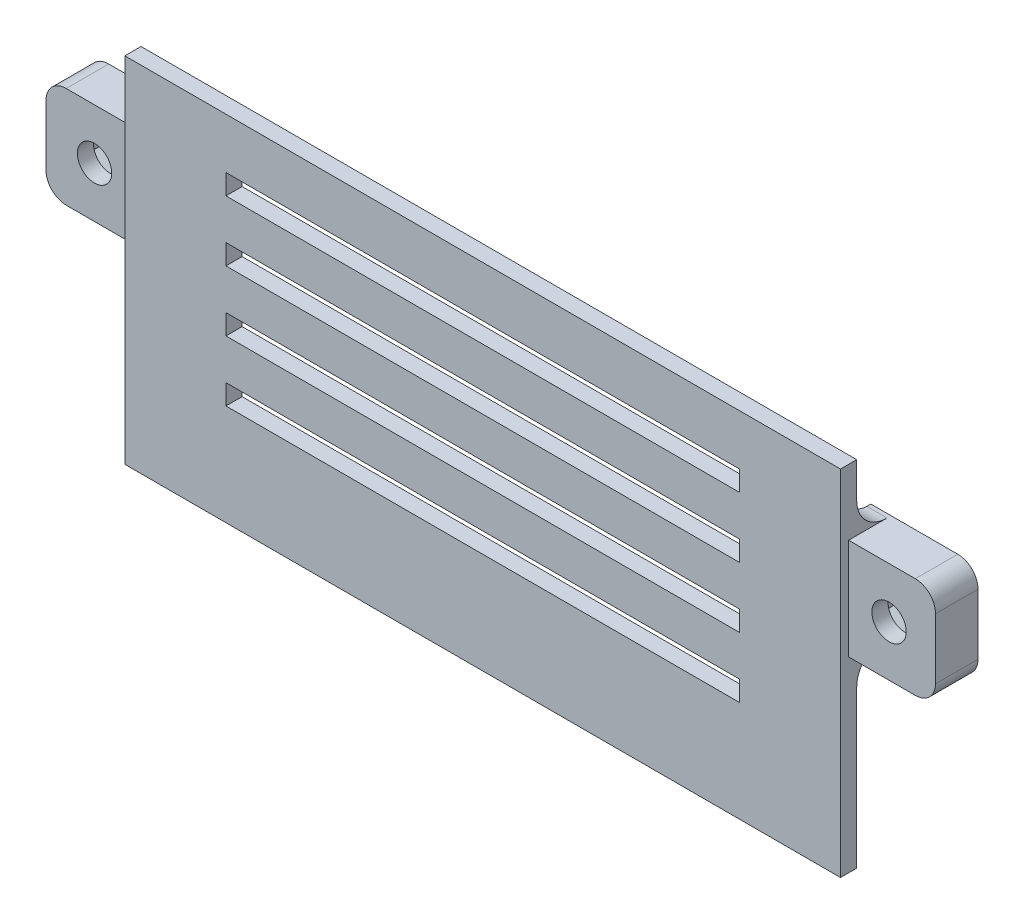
from build123d import *

# Parameters (mm, degrees)
SKETCH1_W                = 70.8
SKETCH1_H                = 35
SKETCH1_W_2              = 50.8
SKETCH1_H_2              = 2
BOSS_EXTRUDE1_DEPTH      = 1.6
BOSS_EXTRUDE2_DEPTH      = 1.6
BOSS_EXTRUDE2_DEPTH_BACK = 3.4
SKETCH2_W                = 8.6
SKETCH2_H                = 10
SKETCH5_W                = 2
SKETCH5_H                = 10
BOSS_EXTRUDE3_DEPTH      = 3.4
SKETCH6_W                = 8.6
SKETCH6_H                = 10
CUT_EXTRUDE1_DEPTH       = 0.8
CUT_EXTRUDE2_DEPTH       = 2.6
CUT_EXTRUDE3_DEPTH       = 10
CUT_EXTRUDE3_DEPTH_BACK  = 11.6
SKETCH3_R                = 1.7
FILLET1_R                = 3
FILLET2_R                = 2


with BuildPart() as part:
    # Sketch1 → Boss-Extrude1 (new body)
    with BuildSketch(Plane.XY):
        with Locations((2.075838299, -17.535774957)):
            Rectangle(SKETCH1_W, SKETCH1_H)
        with Locations((2.075838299, -6.035774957)):
            Rectangle(SKETCH1_W_2, SKETCH1_H_2, mode=Mode.SUBTRACT)
        with Locations((2.075838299, -12.035774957)):
            Rectangle(SKETCH1_W_2, SKETCH1_H_2, mode=Mode.SUBTRACT)
        with Locations((2.075838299, -18.035774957)):
            Rectangle(SKETCH1_W_2, SKETCH1_H_2, mode=Mode.SUBTRACT)
        with Locations((2.075838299, -24.035774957)):
            Rectangle(SKETCH1_W_2, SKETCH1_H_2, mode=Mode.SUBTRACT)
    extrude(amount=BOSS_EXTRUDE1_DEPTH)

    # Sketch2 → Boss-Extrude2 (add, two sides: drawn at the far end of the back side and taken through both)
    with BuildSketch(Plane.XY.offset(-BOSS_EXTRUDE2_DEPTH_BACK)):
        with Locations((-37.624161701, -11.535774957)):
            Rectangle(SKETCH2_W, SKETCH2_H)
        with Locations((41.775838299, -11.535774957)):
            Rectangle(SKETCH2_W, SKETCH2_H)
    extrude(amount=BOSS_EXTRUDE2_DEPTH + BOSS_EXTRUDE2_DEPTH_BACK)

    # Sketch5 → Boss-Extrude3 (add)
    with BuildSketch(Plane.XY):
        with Locations((-32.324161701, -11.535774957)):
            Rectangle(SKETCH5_W, SKETCH5_H)
        with Locations((36.475838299, -11.535774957)):
            Rectangle(SKETCH5_W, SKETCH5_H)
    extrude(amount=-BOSS_EXTRUDE3_DEPTH)

    # Sketch6 → Cut-Extrude1 (cut)
    with BuildSketch(Plane.XY.offset(1.6)):
        with Locations((-37.624161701, -11.535774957)):
            Rectangle(SKETCH6_W, SKETCH6_H)
        with Locations((41.775838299, -11.535774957)):
            Rectangle(SKETCH6_W, SKETCH6_H)
    extrude(amount=-CUT_EXTRUDE1_DEPTH, mode=Mode.SUBTRACT)

    # Sketch7 → Cut-Extrude2 (cut)
    with BuildSketch(Plane(origin=(0, 0, -3.4), x_dir=(-1, 0, 0), z_dir=(0, 0, -1))):
        Polygon((37.124161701, -14.768936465), (39.924161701, -13.152355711), (39.924161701, -9.919194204), (37.124161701, -8.30261345), (34.324161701, -9.919194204), (34.324161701, -13.152355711), align=None)
        Polygon((-41.475838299, -14.768936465), (-38.675838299, -13.152355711), (-38.675838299, -9.919194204), (-41.475838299, -8.30261345), (-44.275838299, -9.919194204), (-44.275838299, -13.152355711), align=None)
    extrude(amount=-CUT_EXTRUDE2_DEPTH, mode=Mode.SUBTRACT)

    # Sketch3 → Cut-Extrude3 (cut, two sides: drawn at the far end of the back side and taken through both)
    with BuildSketch(Plane.XY.offset(-CUT_EXTRUDE3_DEPTH_BACK)):
        with Locations(Location((-37.124161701, -11.535774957, 0), (0, 0, 180))):
            Circle(SKETCH3_R)
        with Locations(Location((41.475838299, -11.535774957, 0), (0, 0, 180))):
            Circle(SKETCH3_R)
    extrude(amount=CUT_EXTRUDE3_DEPTH + CUT_EXTRUDE3_DEPTH_BACK, mode=Mode.SUBTRACT)

    # Fillet1
    fillet1_edges = [part.edges().sort_by_distance(p)[0] for p in [
        (36.475838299, -6.535774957, 0),
        (35.475838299, -11.535774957, 0),
        (36.475838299, -16.535774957, 0),
        (-32.324161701, -16.535774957, 0),
        (-31.324161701, -11.535774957, 0),
        (-32.324161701, -6.535774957, 0),
    ]]
    fillet(fillet1_edges, radius=FILLET1_R)

    # Fillet2
    fillet2_edges = [part.edges().sort_by_distance(p)[0] for p in [
        (-41.924161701, -16.535774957, -1.3),
        (-41.924161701, -6.535774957, -1.3),
        (46.075838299, -6.535774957, -1.3),
        (46.075838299, -16.535774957, -1.3),
    ]]
    fillet(fillet2_edges, radius=FILLET2_R)


solid = part.part
